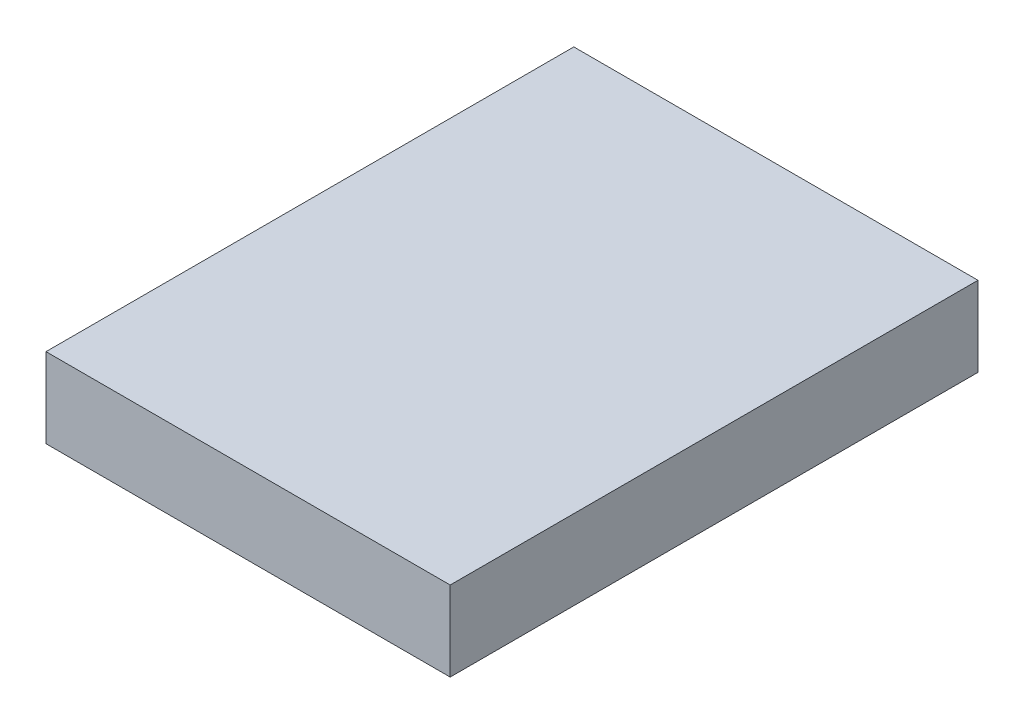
from build123d import *

# Parameters (mm, degrees)
SKETCH1_W      = 101.364890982
SKETCH1_H      = 132.36949937
EXTRUDE1_DEPTH = 20


with BuildPart() as part:
    # Sketch1 → Extrude1 (new body)
    with BuildSketch(Plane(origin=(0, 0, 0), x_dir=(1, 0, 0), z_dir=(0, 1, 0))):
        Rectangle(SKETCH1_W, SKETCH1_H)
    extrude(amount=EXTRUDE1_DEPTH)


solid = part.part
